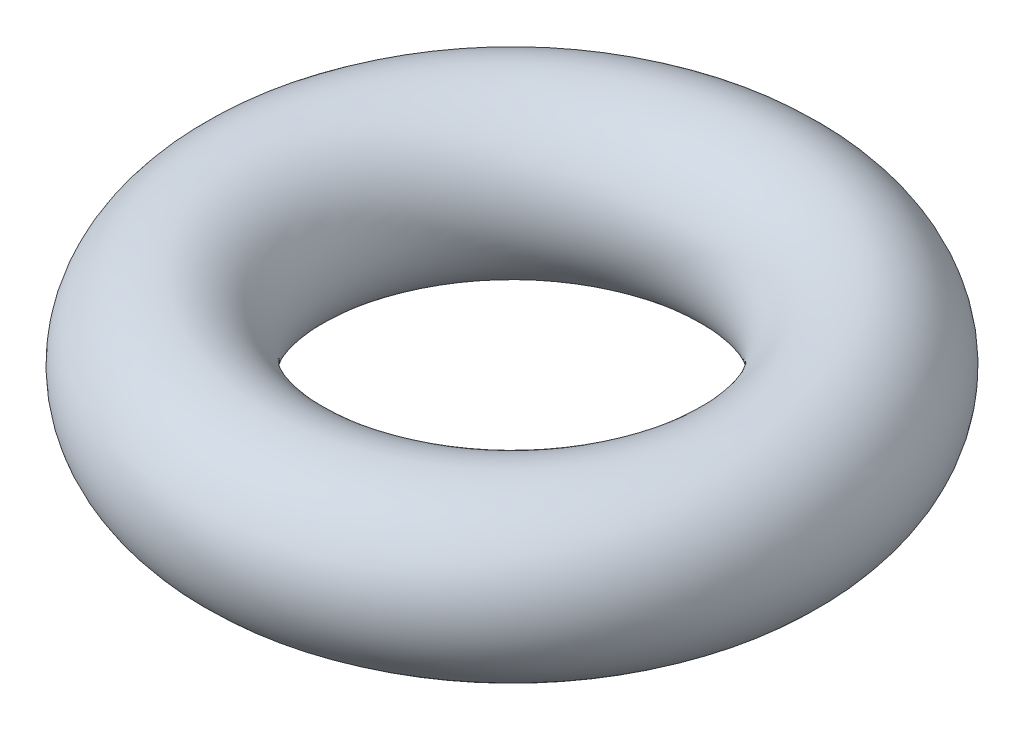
from build123d import *

# Parameters (mm, degrees)
ESQUISSE1_R = 1.5


with BuildPart() as part:
    # Esquisse1 → Base-R_volution (revolve)
    with BuildSketch(Plane.XY, mode=Mode.PRIVATE) as base_r_volution_sk:
        with Locations((4.5, 0)):
            Circle(ESQUISSE1_R)
    revolve(base_r_volution_sk.sketch.rotate(Axis((0, 0, 0), (0, 1, 0)), 90), axis=Axis((0, 0, 0), (0, 1, 0)))


solid = part.part
